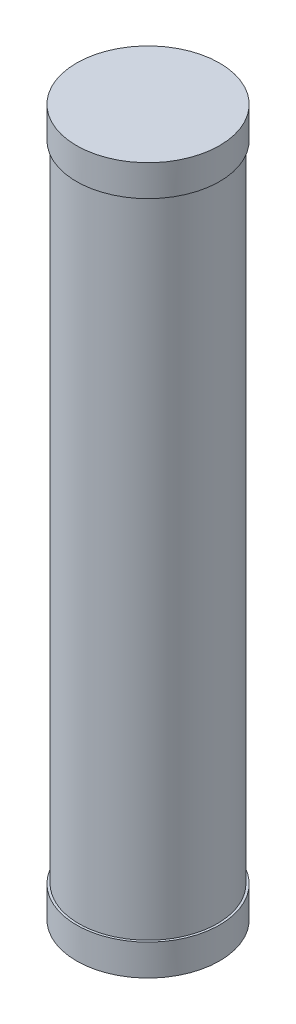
from build123d import *

# Parameters (mm, degrees)
CROQUIS2_R              = 30
SALIENTE_EXTRUIR1_DEPTH = 151.5
CROQUIS3_R              = 31
SALIENTE_EXTRUIR2_DEPTH = 1.5
CROQUIS4_R              = 31
CROQUIS4_R_2            = 30
SALIENTE_EXTRUIR3_DEPTH = 12


with BuildPart() as part:
    # Croquis2 → Saliente-Extruir1 (new, symmetric)
    with BuildSketch(Plane(origin=(0, 0, 0), x_dir=(1, 0, 0), z_dir=(0, 1, 0))):
        with Locations(Location((0, 0, 0), (0, 0, 270))):
            Circle(CROQUIS2_R)
    extrude(amount=SALIENTE_EXTRUIR1_DEPTH, both=True)


with BuildPart() as body_2:
    # Croquis3 → Saliente-Extruir2 (new body)
    with BuildSketch(Plane(origin=(0, 151.5, 0), x_dir=(1, 0, 0), z_dir=(0, 1, 0))):
        with Locations(Location((0, 0, 0), (0, 0, 270))):
            Circle(CROQUIS3_R)
    extrude(amount=SALIENTE_EXTRUIR2_DEPTH)

    # Croquis4 → Saliente-Extruir3 (add)
    with BuildSketch(Plane.XZ.offset(-151.5)):
        with Locations(Location((0, 0, 0), (0, 0, 270))):
            Circle(CROQUIS4_R)
        with Locations(Location((0, 0, 0), (0, 0, 270))):
            Circle(CROQUIS4_R_2, mode=Mode.SUBTRACT)
    extrude(amount=SALIENTE_EXTRUIR3_DEPTH)


with BuildPart() as body_3:
    # Simetr_a2: mirrored copy
    add(body_2.part.mirror(Plane.ZX))


solid = Compound([part.part, body_2.part, body_3.part])
